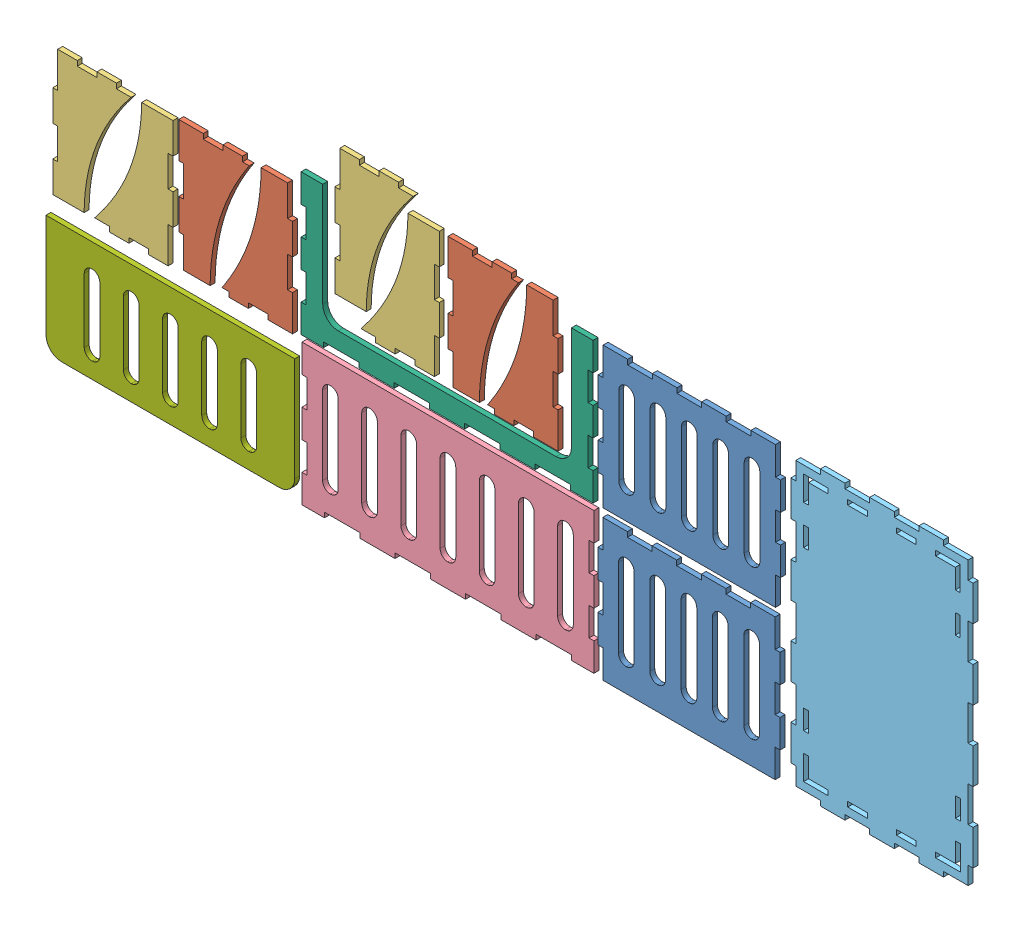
SolidWorks assembly Assem1.SLDASM, configuration Default (file format 9000). Lengths in mm.
Overall size (3005.45 1067.79 16).
14 component instances, 7 part files, 4 mates.
Components (placement in the parent):
- base-width-1: base-width.SLDPRT [Default] at (816.7997 248.2991 1042.1676) size (590.8 457.2 16)
- base-width-2: base-width.SLDPRT [Default] at (817.8954 732.6582 1042.1676) size (590.8 457.2 16)
- bottom female-1: bottom female.SLDPRT [Default] at (-60.1157 599.1347 1042.1676) size (228.5 416 16)
- bottom female-2: bottom female.SLDPRT [Default] at (296.6014 1006.3072 1042.1676) x (-1 0 0) z (0 0 1) size (228.5 416 16)
- bottom female-3: bottom female.SLDPRT [Default] at (-932.9681 490.9359 1042.1676) size (228.5 416 16)
- bottom female-4: bottom female.SLDPRT [Default] at (-564.4173 904.9415 1042.1676) x (-1 0 0) z (0 0 1) size (228.5 416 16)
- bottom male-1: bottom male.SLDPRT [Default] at (-88.3744 1015.0206 1042.1676) x (-1 0 0) z (0 0 1) size (254 416 16)
- bottom male-2: bottom male.SLDPRT [Default] at (-426.9825 670.9932 1042.1676) size (254 416 16)
- bottom male-3: bottom male.SLDPRT [Default] at (-1341.4689 491.7647 1042.1676) size (254 416 16)
- bottom male-4: bottom male.SLDPRT [Default] at (-951.7183 894.3334 1042.1676) x (-1 0 0) z (0 0 1) size (254 416 16)
- base-length-3: base-length.SLDPRT [Default] at (-20.5867 610.1801 1042.1676) x (0 1 0) z (0 0 1) size (457.2 946.4 16)
- bed-2: bed.SLDPRT [Default] at (2033.7194 492.4031 1042.1676) size (590.8 946.4 16)
- wndow-border-1: wndow-border.SLDPRT [Default] at (-23.2646 1086.8148 1042.1676) x (0 1 0) z (0 0 1) size (457.2 946.4 16)
- base-length-window-1: base-length-window.SLDPRT [Default] at (-948.971 551.3253 1042.1676) x (0 1 0) z (0 0 1) size (386.44 806.4 16)
Mates (geometry in assembly coordinates):
- Coincident1: coincident aligned: plane of base-length-3 through (-20.5867 610.1801 1058.1676) normal (0 0 1); plane of wndow-border-1 through (-23.2646 1086.8148 1058.1676) normal (0 0 1)
- Coincident2: coincident aligned: plane of bottom male-1 through (-228.887 808.158 1058.1676) normal (0 0 1); plane of base-length-3 through (-20.5867 610.1801 1058.1676) normal (0 0 1)
- Coincident3: coincident aligned: plane of bottom male-2 through (-286.4699 877.8558 1058.1676) normal (0 0 1); plane of base-length-3 through (-20.5867 610.1801 1058.1676) normal (0 0 1)
- Coincident4: coincident aligned: plane of base-length-3 through (-20.5867 610.1801 1058.1676) normal (0 0 1); plane of base-length-window-1 through (-948.971 551.3253 1058.1676) normal (0 0 1)
